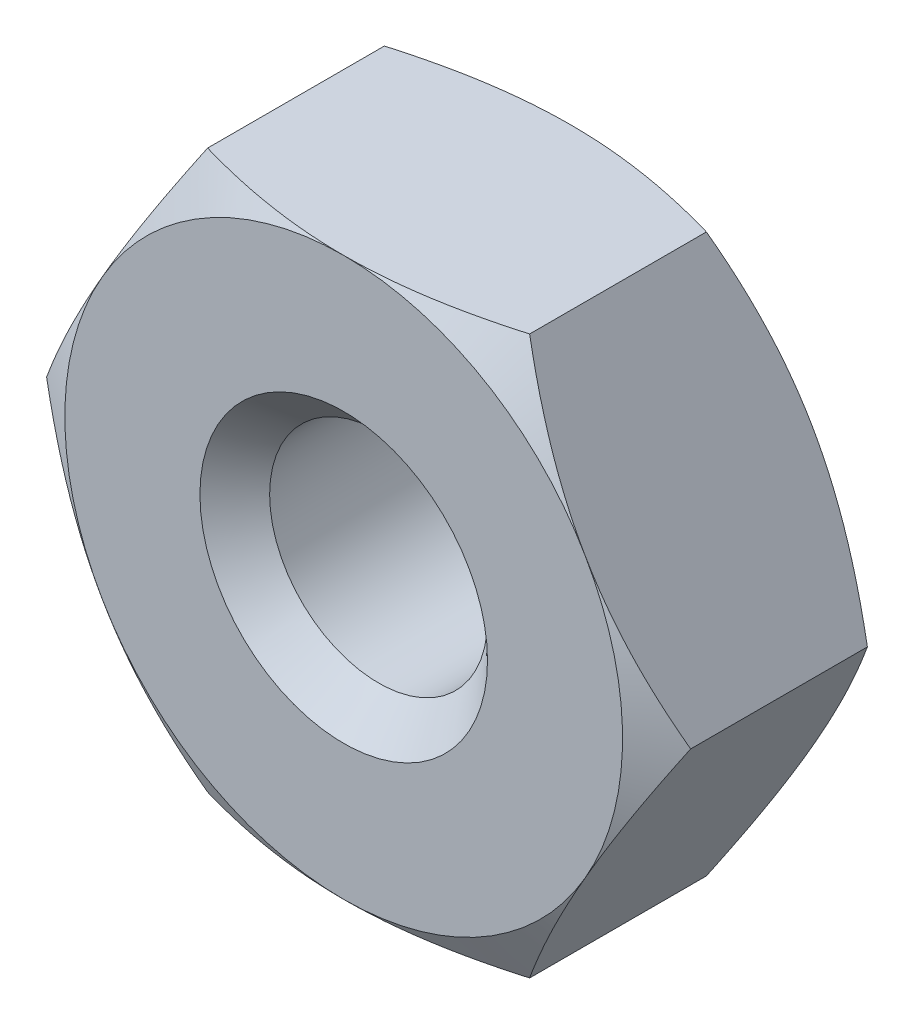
from build123d import *

# Parameters (mm, degrees)
AUFSATZ_LINEAR_AUSTRAGEN1_DEPTH = 0.65
SKIZZE2_OUTSIDE_W               = 19.762
SKIZZE2_OUTSIDE_H               = 19.266
SKIZZE2_OUTSIDE_R               = 1.6
SCHNITT_LINEAR_AUSTRAGEN1_DEPTH = 3.768272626
SCHNITT_LINEAR_AUSTRAGEN1_DRAFT = -60
SPIEGELN1_COPY_1_SKETCH_W       = 19.762
SPIEGELN1_COPY_1_SKETCH_H       = 19.266
SPIEGELN1_COPY_1_SKETCH_R       = 1.6
SPIEGELN1_COPY_1_DEPTH          = 3.768272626
SPIEGELN1_COPY_1_DRAFT          = -60
GEWINDEBOHRUNG0_D               = 1.25
FASE1_SIZE                      = 0.2


with BuildPart() as part:
    # Skizze1 → Aufsatz-Linear austragen1 (new, symmetric)
    with BuildSketch(Plane.XY):
        Polygon((1.847520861, 0), (0.923760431, 1.6), (-0.923760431, 1.6), (-1.847520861, 0), (-0.923760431, -1.6), (0.923760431, -1.6), align=None)
    extrude(amount=AUFSATZ_LINEAR_AUSTRAGEN1_DEPTH, both=True)


with BuildPart() as schnitt_linear_austragen1_tool:
    # Skizze2 outside → Schnitt-Linear austragen1 (with draft: the straight prism first)
    with BuildSketch(Plane.XY.offset(0.65)):
        Rectangle(SKIZZE2_OUTSIDE_W, SKIZZE2_OUTSIDE_H)
        Circle(SKIZZE2_OUTSIDE_R, mode=Mode.SUBTRACT)
    extrude(amount=-SCHNITT_LINEAR_AUSTRAGEN1_DEPTH)
    # Schnitt-Linear austragen1: the draft: its side faces are tilted about the plane it starts from
    schnitt_linear_austragen1_sides = [schnitt_linear_austragen1_tool.faces().sort_by_distance(p)[0] for p in [
        (0, -9.633, -1.234136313),
        (9.881, 0, -1.234136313),
        (0, 9.633, -1.234136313),
        (-9.881, 0, -1.234136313),
        (-1.6, 0, -1.234136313),
    ]]
    draft(schnitt_linear_austragen1_sides, Plane.XY.offset(0.65), SCHNITT_LINEAR_AUSTRAGEN1_DRAFT)


with BuildPart() as part_1:
    add(part.part)

    # Schnitt-Linear austragen1: cut by schnitt_linear_austragen1_tool
    add(schnitt_linear_austragen1_tool.part, mode=Mode.SUBTRACT)


with BuildPart() as spiegeln1_copy_1_tool:
    # Spiegeln1 copy 1 sketch → Spiegeln1 copy 1 (with draft: the straight prism first)
    with BuildSketch(Plane(origin=(0, 0, -0.65), x_dir=(1, 0, 0), z_dir=(0, 0, -1))):
        Rectangle(SPIEGELN1_COPY_1_SKETCH_W, SPIEGELN1_COPY_1_SKETCH_H)
        Circle(SPIEGELN1_COPY_1_SKETCH_R, mode=Mode.SUBTRACT)
    extrude(amount=-SPIEGELN1_COPY_1_DEPTH)
    # Spiegeln1 copy 1: the draft: its side faces are tilted about the plane it starts from
    spiegeln1_copy_1_sides = [spiegeln1_copy_1_tool.faces().sort_by_distance(p)[0] for p in [
        (0, -9.633, 1.234136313),
        (9.881, 0, 1.234136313),
        (0, 9.633, 1.234136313),
        (-9.881, 0, 1.234136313),
        (-1.6, 0, 1.234136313),
    ]]
    draft(spiegeln1_copy_1_sides, Plane(origin=(0, 0, -0.65), x_dir=(1, 0, 0), z_dir=(0, 0, -1)), SPIEGELN1_COPY_1_DRAFT)


with BuildPart() as part_2:
    add(part_1.part)

    # Spiegeln1 copy 1: cut by spiegeln1_copy_1_tool
    add(spiegeln1_copy_1_tool.part, mode=Mode.SUBTRACT)

    # Gewindebohrung0 (through all)
    with Locations(Plane.XY.offset(0.65)):
        with Locations((0, 0)):
            Hole(GEWINDEBOHRUNG0_D / 2)

    # Fase1
    fase1_edges = [part_2.edges().sort_by_distance(p)[0] for p in [
        (0.625, 0, 0.65),
        (0.625, 0, -0.65),
    ]]
    chamfer(fase1_edges, length=FASE1_SIZE)


solid = part_2.part
